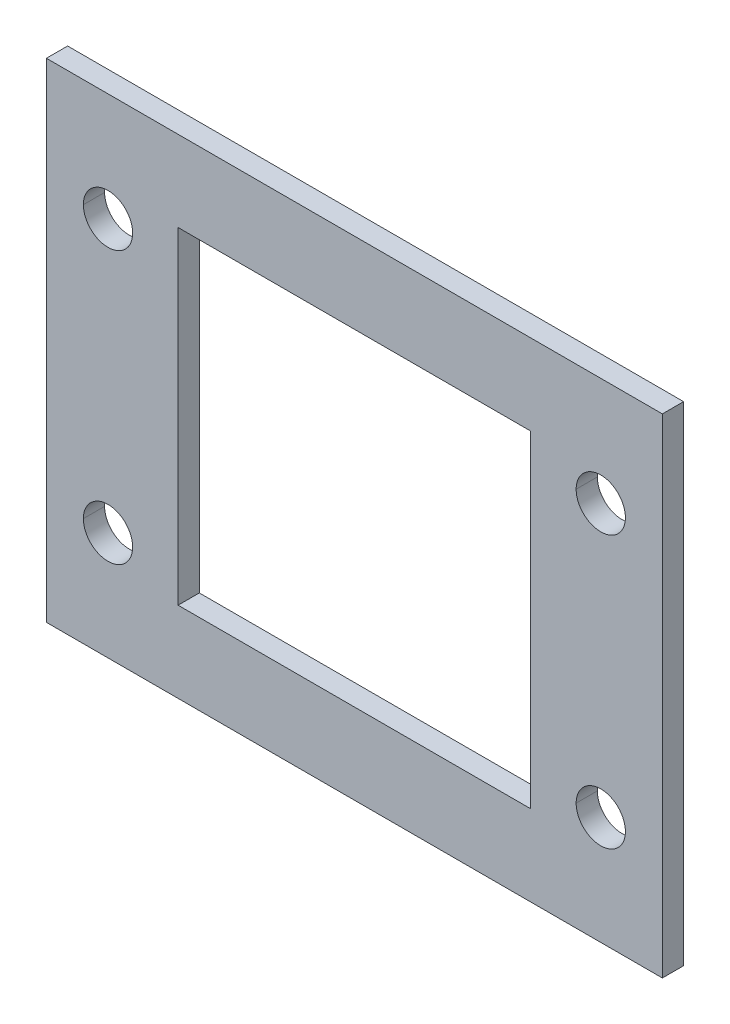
ISO-10303-21;
HEADER;
FILE_DESCRIPTION(('STEP AP214'),'2;1');
FILE_NAME('part.step','',(''),(''),'','','');
FILE_SCHEMA(('AUTOMOTIVE_DESIGN { 1 0 10303 214 1 1 1 1 }'));
ENDSEC;
DATA;
#1=APPLICATION_CONTEXT('core data for automotive mechanical design processes');
#2=APPLICATION_PROTOCOL_DEFINITION('international standard','automotive_design',2000,#1);
#3=PRODUCT_CONTEXT('',#1,'mechanical');
#4=PRODUCT('Part','Part','',(#3));
#5=PRODUCT_RELATED_PRODUCT_CATEGORY('part','',(#4));
#6=PRODUCT_DEFINITION_FORMATION('','',#4);
#7=PRODUCT_DEFINITION_CONTEXT('part definition',#1,'design');
#8=PRODUCT_DEFINITION('design','',#6,#7);
#9=PRODUCT_DEFINITION_SHAPE('','',#8);
#10=(LENGTH_UNIT() NAMED_UNIT(*) SI_UNIT(.MILLI.,.METRE.));
#11=(NAMED_UNIT(*) PLANE_ANGLE_UNIT() SI_UNIT($,.RADIAN.));
#12=(NAMED_UNIT(*) SI_UNIT($,.STERADIAN.) SOLID_ANGLE_UNIT());
#13=UNCERTAINTY_MEASURE_WITH_UNIT(LENGTH_MEASURE(1.E-05),#10,'distance_accuracy_value','');
#14=(GEOMETRIC_REPRESENTATION_CONTEXT(3) GLOBAL_UNCERTAINTY_ASSIGNED_CONTEXT((#13)) GLOBAL_UNIT_ASSIGNED_CONTEXT((#10,
#11,#12)) REPRESENTATION_CONTEXT('',''));
#15=CARTESIAN_POINT('',(0.,0.,0.));
#16=DIRECTION('',(0.,0.,1.));
#17=DIRECTION('',(1.,0.,0.));
#18=AXIS2_PLACEMENT_3D('',#15,#16,#17);
#19=CARTESIAN_POINT('',(3.82808590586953,41.3391777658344,23.2084991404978));
#20=DIRECTION('',(0.,0.,-1.));
#21=DIRECTION('',(-1.,0.,0.));
#22=AXIS2_PLACEMENT_3D('',#19,#20,#21);
#23=CYLINDRICAL_SURFACE('',#22,2.9);
#24=DIRECTION('',(0.,0.,-1.));
#25=VECTOR('',#24,1.);
#26=CARTESIAN_POINT('',(6.72808590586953,41.3391777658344,23.2084991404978));
#27=LINE('',#26,#25);
#28=CARTESIAN_POINT('',(6.72808590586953,41.3391777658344,15.0060604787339));
#29=VERTEX_POINT('',#28);
#30=CARTESIAN_POINT('',(6.72808590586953,41.3391777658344,12.5060604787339));
#31=VERTEX_POINT('',#30);
#32=EDGE_CURVE('E496',#29,#31,#27,.T.);
#33=ORIENTED_EDGE('',*,*,#32,.F.);
#34=CARTESIAN_POINT('',(3.82808590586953,41.3391777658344,15.0060604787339));
#35=DIRECTION('',(0.,0.,-1.));
#36=DIRECTION('',(-1.,0.,0.));
#37=AXIS2_PLACEMENT_3D('',#34,#35,#36);
#38=CIRCLE('',#37,2.9);
#39=CARTESIAN_POINT('',(0.92808590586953,41.3391777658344,15.0060604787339));
#40=VERTEX_POINT('',#39);
#41=EDGE_CURVE('E238',#40,#29,#38,.T.);
#42=ORIENTED_EDGE('',*,*,#41,.F.);
#43=DIRECTION('',(0.,0.,-1.));
#44=VECTOR('',#43,1.);
#45=CARTESIAN_POINT('',(0.92808590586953,41.3391777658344,23.2084991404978));
#46=LINE('',#45,#44);
#47=CARTESIAN_POINT('',(0.92808590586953,41.3391777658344,12.5060604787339));
#48=VERTEX_POINT('',#47);
#49=EDGE_CURVE('E490',#40,#48,#46,.T.);
#50=ORIENTED_EDGE('',*,*,#49,.T.);
#51=CARTESIAN_POINT('',(3.82808590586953,41.3391777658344,12.5060604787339));
#52=DIRECTION('',(0.,0.,1.));
#53=DIRECTION('',(1.,0.,0.));
#54=AXIS2_PLACEMENT_3D('',#51,#52,#53);
#55=CIRCLE('',#54,2.9);
#56=EDGE_CURVE('E242',#31,#48,#55,.T.);
#57=ORIENTED_EDGE('',*,*,#56,.F.);
#58=EDGE_LOOP('',(#33,#42,#50,#57));
#59=FACE_BOUND('',#58,.T.);
#60=ADVANCED_FACE('F15',(#59),#23,.F.);
#61=CARTESIAN_POINT('',(-54.1719140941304,41.3391777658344,23.2084991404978));
#62=DIRECTION('',(0.,0.,-1.));
#63=DIRECTION('',(-1.,0.,0.));
#64=AXIS2_PLACEMENT_3D('',#61,#62,#63);
#65=CYLINDRICAL_SURFACE('',#64,2.9);
#66=DIRECTION('',(0.,0.,-1.));
#67=VECTOR('',#66,1.);
#68=CARTESIAN_POINT('',(-51.2719140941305,41.3391777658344,23.2084991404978));
#69=LINE('',#68,#67);
#70=CARTESIAN_POINT('',(-51.2719140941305,41.3391777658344,15.0060604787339));
#71=VERTEX_POINT('',#70);
#72=CARTESIAN_POINT('',(-51.2719140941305,41.3391777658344,12.5060604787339));
#73=VERTEX_POINT('',#72);
#74=EDGE_CURVE('E512',#71,#73,#69,.T.);
#75=ORIENTED_EDGE('',*,*,#74,.F.);
#76=CARTESIAN_POINT('',(-54.1719140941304,41.3391777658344,15.0060604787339));
#77=DIRECTION('',(0.,0.,-1.));
#78=DIRECTION('',(-1.,0.,0.));
#79=AXIS2_PLACEMENT_3D('',#76,#77,#78);
#80=CIRCLE('',#79,2.9);
#81=CARTESIAN_POINT('',(-57.0719140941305,41.3391777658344,15.0060604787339));
#82=VERTEX_POINT('',#81);
#83=EDGE_CURVE('E235',#82,#71,#80,.T.);
#84=ORIENTED_EDGE('',*,*,#83,.F.);
#85=DIRECTION('',(0.,0.,-1.));
#86=VECTOR('',#85,1.);
#87=CARTESIAN_POINT('',(-57.0719140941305,41.3391777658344,23.2084991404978));
#88=LINE('',#87,#86);
#89=CARTESIAN_POINT('',(-57.0719140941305,41.3391777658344,12.5060604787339));
#90=VERTEX_POINT('',#89);
#91=EDGE_CURVE('E175',#82,#90,#88,.T.);
#92=ORIENTED_EDGE('',*,*,#91,.T.);
#93=CARTESIAN_POINT('',(-54.1719140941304,41.3391777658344,12.5060604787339));
#94=DIRECTION('',(0.,0.,1.));
#95=DIRECTION('',(1.,0.,0.));
#96=AXIS2_PLACEMENT_3D('',#93,#94,#95);
#97=CIRCLE('',#96,2.9);
#98=EDGE_CURVE('E169',#73,#90,#97,.T.);
#99=ORIENTED_EDGE('',*,*,#98,.F.);
#100=EDGE_LOOP('',(#75,#84,#92,#99));
#101=FACE_BOUND('',#100,.T.);
#102=ADVANCED_FACE('F433',(#101),#65,.F.);
#103=CARTESIAN_POINT('',(3.82808590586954,9.33917776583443,71.6143637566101));
#104=DIRECTION('',(0.,0.,-1.));
#105=DIRECTION('',(-1.,0.,0.));
#106=AXIS2_PLACEMENT_3D('',#103,#104,#105);
#107=CYLINDRICAL_SURFACE('',#106,2.9);
#108=DIRECTION('',(0.,0.,-1.));
#109=VECTOR('',#108,1.);
#110=CARTESIAN_POINT('',(6.72808590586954,9.33917776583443,71.6143637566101));
#111=LINE('',#110,#109);
#112=CARTESIAN_POINT('',(6.72808590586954,9.33917776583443,15.0060604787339));
#113=VERTEX_POINT('',#112);
#114=CARTESIAN_POINT('',(6.72808590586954,9.33917776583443,12.5060604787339));
#115=VERTEX_POINT('',#114);
#116=EDGE_CURVE('E183',#113,#115,#111,.T.);
#117=ORIENTED_EDGE('',*,*,#116,.F.);
#118=CARTESIAN_POINT('',(3.82808590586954,9.33917776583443,15.0060604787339));
#119=DIRECTION('',(0.,0.,-1.));
#120=DIRECTION('',(-1.,0.,0.));
#121=AXIS2_PLACEMENT_3D('',#118,#119,#120);
#122=CIRCLE('',#121,2.9);
#123=CARTESIAN_POINT('',(0.928085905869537,9.33917776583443,15.0060604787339));
#124=VERTEX_POINT('',#123);
#125=EDGE_CURVE('E230',#124,#113,#122,.T.);
#126=ORIENTED_EDGE('',*,*,#125,.F.);
#127=DIRECTION('',(0.,0.,-1.));
#128=VECTOR('',#127,1.);
#129=CARTESIAN_POINT('',(0.928085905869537,9.33917776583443,71.6143637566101));
#130=LINE('',#129,#128);
#131=CARTESIAN_POINT('',(0.928085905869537,9.33917776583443,12.5060604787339));
#132=VERTEX_POINT('',#131);
#133=EDGE_CURVE('E184',#124,#132,#130,.T.);
#134=ORIENTED_EDGE('',*,*,#133,.T.);
#135=CARTESIAN_POINT('',(3.82808590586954,9.33917776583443,12.5060604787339));
#136=DIRECTION('',(0.,0.,1.));
#137=DIRECTION('',(-1.,0.,0.));
#138=AXIS2_PLACEMENT_3D('',#135,#136,#137);
#139=CIRCLE('',#138,2.9);
#140=EDGE_CURVE('E239',#115,#132,#139,.T.);
#141=ORIENTED_EDGE('',*,*,#140,.F.);
#142=EDGE_LOOP('',(#117,#126,#134,#141));
#143=FACE_BOUND('',#142,.T.);
#144=ADVANCED_FACE('F361',(#143),#107,.F.);
#145=CARTESIAN_POINT('',(-54.1719140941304,9.33917776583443,71.6143637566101));
#146=DIRECTION('',(0.,0.,-1.));
#147=DIRECTION('',(-1.,0.,0.));
#148=AXIS2_PLACEMENT_3D('',#145,#146,#147);
#149=CYLINDRICAL_SURFACE('',#148,2.9);
#150=DIRECTION('',(0.,0.,-1.));
#151=VECTOR('',#150,1.);
#152=CARTESIAN_POINT('',(-51.2719140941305,9.33917776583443,71.6143637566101));
#153=LINE('',#152,#151);
#154=CARTESIAN_POINT('',(-51.2719140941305,9.33917776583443,15.0060604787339));
#155=VERTEX_POINT('',#154);
#156=CARTESIAN_POINT('',(-51.2719140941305,9.33917776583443,12.5060604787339));
#157=VERTEX_POINT('',#156);
#158=EDGE_CURVE('E193',#155,#157,#153,.T.);
#159=ORIENTED_EDGE('',*,*,#158,.F.);
#160=CARTESIAN_POINT('',(-54.1719140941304,9.33917776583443,15.0060604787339));
#161=DIRECTION('',(0.,0.,-1.));
#162=DIRECTION('',(-1.,0.,0.));
#163=AXIS2_PLACEMENT_3D('',#160,#161,#162);
#164=CIRCLE('',#163,2.9);
#165=CARTESIAN_POINT('',(-57.0719140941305,9.33917776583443,15.0060604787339));
#166=VERTEX_POINT('',#165);
#167=EDGE_CURVE('E227',#166,#155,#164,.T.);
#168=ORIENTED_EDGE('',*,*,#167,.F.);
#169=DIRECTION('',(0.,0.,-1.));
#170=VECTOR('',#169,1.);
#171=CARTESIAN_POINT('',(-57.0719140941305,9.33917776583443,71.6143637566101));
#172=LINE('',#171,#170);
#173=CARTESIAN_POINT('',(-57.0719140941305,9.33917776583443,12.5060604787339));
#174=VERTEX_POINT('',#173);
#175=EDGE_CURVE('E194',#166,#174,#172,.T.);
#176=ORIENTED_EDGE('',*,*,#175,.T.);
#177=CARTESIAN_POINT('',(-54.1719140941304,9.33917776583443,12.5060604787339));
#178=DIRECTION('',(0.,0.,1.));
#179=DIRECTION('',(1.,0.,0.));
#180=AXIS2_PLACEMENT_3D('',#177,#178,#179);
#181=CIRCLE('',#180,2.9);
#182=EDGE_CURVE('E163',#157,#174,#181,.T.);
#183=ORIENTED_EDGE('',*,*,#182,.F.);
#184=EDGE_LOOP('',(#159,#168,#176,#183));
#185=FACE_BOUND('',#184,.T.);
#186=ADVANCED_FACE('F355',(#185),#149,.F.);
#187=CARTESIAN_POINT('',(-45.9219140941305,6.08917776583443,71.6143637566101));
#188=DIRECTION('',(1.,0.,0.));
#189=DIRECTION('',(0.,1.,0.));
#190=AXIS2_PLACEMENT_3D('',#187,#188,#189);
#191=PLANE('',#190);
#192=DIRECTION('',(0.,0.,-1.));
#193=VECTOR('',#192,1.);
#194=CARTESIAN_POINT('',(-45.9219140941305,6.08917776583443,71.6143637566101));
#195=LINE('',#194,#193);
#196=CARTESIAN_POINT('',(-45.9219140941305,6.08917776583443,15.0060604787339));
#197=VERTEX_POINT('',#196);
#198=CARTESIAN_POINT('',(-45.9219140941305,6.08917776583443,12.5060604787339));
#199=VERTEX_POINT('',#198);
#200=EDGE_CURVE('E10',#197,#199,#195,.T.);
#201=ORIENTED_EDGE('',*,*,#200,.T.);
#202=DIRECTION('',(0.,-1.,0.));
#203=VECTOR('',#202,1.);
#204=CARTESIAN_POINT('',(-45.9219140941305,6.08917776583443,12.5060604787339));
#205=LINE('',#204,#203);
#206=CARTESIAN_POINT('',(-45.9219140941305,44.5891777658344,12.5060604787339));
#207=VERTEX_POINT('',#206);
#208=EDGE_CURVE('E156',#207,#199,#205,.T.);
#209=ORIENTED_EDGE('',*,*,#208,.F.);
#210=DIRECTION('',(0.,0.,-1.));
#211=VECTOR('',#210,1.);
#212=CARTESIAN_POINT('',(-45.9219140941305,44.5891777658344,71.6143637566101));
#213=LINE('',#212,#211);
#214=CARTESIAN_POINT('',(-45.9219140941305,44.5891777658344,15.0060604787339));
#215=VERTEX_POINT('',#214);
#216=EDGE_CURVE('E149',#215,#207,#213,.T.);
#217=ORIENTED_EDGE('',*,*,#216,.F.);
#218=DIRECTION('',(0.,1.,0.));
#219=VECTOR('',#218,1.);
#220=CARTESIAN_POINT('',(-45.9219140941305,6.08917776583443,15.0060604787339));
#221=LINE('',#220,#219);
#222=EDGE_CURVE('E223',#197,#215,#221,.T.);
#223=ORIENTED_EDGE('',*,*,#222,.F.);
#224=EDGE_LOOP('',(#201,#209,#217,#223));
#225=FACE_BOUND('',#224,.T.);
#226=ADVANCED_FACE('F360',(#225),#191,.T.);
#227=CARTESIAN_POINT('',(-45.9219140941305,6.08917776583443,71.6143637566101));
#228=DIRECTION('',(0.,1.,0.));
#229=DIRECTION('',(1.,0.,0.));
#230=AXIS2_PLACEMENT_3D('',#227,#228,#229);
#231=PLANE('',#230);
#232=DIRECTION('',(0.,0.,-1.));
#233=VECTOR('',#232,1.);
#234=CARTESIAN_POINT('',(-4.42191409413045,6.08917776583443,71.6143637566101));
#235=LINE('',#234,#233);
#236=CARTESIAN_POINT('',(-4.42191409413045,6.08917776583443,15.0060604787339));
#237=VERTEX_POINT('',#236);
#238=CARTESIAN_POINT('',(-4.42191409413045,6.08917776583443,12.5060604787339));
#239=VERTEX_POINT('',#238);
#240=EDGE_CURVE('E18',#237,#239,#235,.T.);
#241=ORIENTED_EDGE('',*,*,#240,.T.);
#242=DIRECTION('',(1.,0.,0.));
#243=VECTOR('',#242,1.);
#244=CARTESIAN_POINT('',(-45.9219140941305,6.08917776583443,12.5060604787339));
#245=LINE('',#244,#243);
#246=EDGE_CURVE('E161',#199,#239,#245,.T.);
#247=ORIENTED_EDGE('',*,*,#246,.F.);
#248=ORIENTED_EDGE('',*,*,#200,.F.);
#249=DIRECTION('',(-1.,0.,0.));
#250=VECTOR('',#249,1.);
#251=CARTESIAN_POINT('',(-45.9219140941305,6.08917776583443,15.0060604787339));
#252=LINE('',#251,#250);
#253=EDGE_CURVE('E219',#237,#197,#252,.T.);
#254=ORIENTED_EDGE('',*,*,#253,.F.);
#255=EDGE_LOOP('',(#241,#247,#248,#254));
#256=FACE_BOUND('',#255,.T.);
#257=ADVANCED_FACE('F409',(#256),#231,.T.);
#258=CARTESIAN_POINT('',(-4.42191409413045,6.08917776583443,71.6143637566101));
#259=DIRECTION('',(-1.,0.,0.));
#260=DIRECTION('',(0.,0.,1.));
#261=AXIS2_PLACEMENT_3D('',#258,#259,#260);
#262=PLANE('',#261);
#263=DIRECTION('',(0.,0.,-1.));
#264=VECTOR('',#263,1.);
#265=CARTESIAN_POINT('',(-4.42191409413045,44.5891777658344,71.6143637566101));
#266=LINE('',#265,#264);
#267=CARTESIAN_POINT('',(-4.42191409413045,44.5891777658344,15.0060604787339));
#268=VERTEX_POINT('',#267);
#269=CARTESIAN_POINT('',(-4.42191409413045,44.5891777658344,12.5060604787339));
#270=VERTEX_POINT('',#269);
#271=EDGE_CURVE('E138',#268,#270,#266,.T.);
#272=ORIENTED_EDGE('',*,*,#271,.T.);
#273=DIRECTION('',(0.,1.,0.));
#274=VECTOR('',#273,1.);
#275=CARTESIAN_POINT('',(-4.42191409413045,6.08917776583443,12.5060604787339));
#276=LINE('',#275,#274);
#277=EDGE_CURVE('E142',#239,#270,#276,.T.);
#278=ORIENTED_EDGE('',*,*,#277,.F.);
#279=ORIENTED_EDGE('',*,*,#240,.F.);
#280=DIRECTION('',(0.,-1.,0.));
#281=VECTOR('',#280,1.);
#282=CARTESIAN_POINT('',(-4.42191409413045,6.08917776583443,15.0060604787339));
#283=LINE('',#282,#281);
#284=EDGE_CURVE('E144',#268,#237,#283,.T.);
#285=ORIENTED_EDGE('',*,*,#284,.F.);
#286=EDGE_LOOP('',(#272,#278,#279,#285));
#287=FACE_BOUND('',#286,.T.);
#288=ADVANCED_FACE('F140',(#287),#262,.T.);
#289=CARTESIAN_POINT('',(-45.9219140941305,44.5891777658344,71.6143637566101));
#290=DIRECTION('',(0.,-1.,0.));
#291=DIRECTION('',(0.,0.,-1.));
#292=AXIS2_PLACEMENT_3D('',#289,#290,#291);
#293=PLANE('',#292);
#294=ORIENTED_EDGE('',*,*,#216,.T.);
#295=DIRECTION('',(-1.,0.,0.));
#296=VECTOR('',#295,1.);
#297=CARTESIAN_POINT('',(-45.9219140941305,44.5891777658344,12.5060604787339));
#298=LINE('',#297,#296);
#299=EDGE_CURVE('E151',#270,#207,#298,.T.);
#300=ORIENTED_EDGE('',*,*,#299,.F.);
#301=ORIENTED_EDGE('',*,*,#271,.F.);
#302=DIRECTION('',(1.,0.,0.));
#303=VECTOR('',#302,1.);
#304=CARTESIAN_POINT('',(-45.9219140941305,44.5891777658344,15.0060604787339));
#305=LINE('',#304,#303);
#306=EDGE_CURVE('E214',#215,#268,#305,.T.);
#307=ORIENTED_EDGE('',*,*,#306,.F.);
#308=EDGE_LOOP('',(#294,#300,#301,#307));
#309=FACE_BOUND('',#308,.T.);
#310=ADVANCED_FACE('F152',(#309),#293,.T.);
#311=CARTESIAN_POINT('',(-61.4219140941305,54.0891777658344,15.0060604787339));
#312=DIRECTION('',(0.,-1.,0.));
#313=DIRECTION('',(0.,0.,-1.));
#314=AXIS2_PLACEMENT_3D('',#311,#312,#313);
#315=PLANE('',#314);
#316=DIRECTION('',(-1.,0.,0.));
#317=VECTOR('',#316,1.);
#318=CARTESIAN_POINT('',(-61.4219140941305,54.0891777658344,12.5060604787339));
#319=LINE('',#318,#317);
#320=CARTESIAN_POINT('',(11.0780859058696,54.0891777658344,12.5060604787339));
#321=VERTEX_POINT('',#320);
#322=CARTESIAN_POINT('',(-61.4219140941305,54.0891777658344,12.5060604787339));
#323=VERTEX_POINT('',#322);
#324=EDGE_CURVE('E249',#321,#323,#319,.T.);
#325=ORIENTED_EDGE('',*,*,#324,.T.);
#326=DIRECTION('',(0.,0.,-1.));
#327=VECTOR('',#326,1.);
#328=CARTESIAN_POINT('',(-61.4219140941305,54.0891777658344,15.0060604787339));
#329=LINE('',#328,#327);
#330=CARTESIAN_POINT('',(-61.4219140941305,54.0891777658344,15.0060604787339));
#331=VERTEX_POINT('',#330);
#332=EDGE_CURVE('E264',#331,#323,#329,.T.);
#333=ORIENTED_EDGE('',*,*,#332,.F.);
#334=DIRECTION('',(-1.,0.,0.));
#335=VECTOR('',#334,1.);
#336=CARTESIAN_POINT('',(-61.4219140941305,54.0891777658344,15.0060604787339));
#337=LINE('',#336,#335);
#338=CARTESIAN_POINT('',(11.0780859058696,54.0891777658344,15.0060604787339));
#339=VERTEX_POINT('',#338);
#340=EDGE_CURVE('E210',#339,#331,#337,.T.);
#341=ORIENTED_EDGE('',*,*,#340,.F.);
#342=DIRECTION('',(0.,0.,-1.));
#343=VECTOR('',#342,1.);
#344=CARTESIAN_POINT('',(11.0780859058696,54.0891777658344,15.0060604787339));
#345=LINE('',#344,#343);
#346=EDGE_CURVE('E270',#339,#321,#345,.T.);
#347=ORIENTED_EDGE('',*,*,#346,.T.);
#348=EDGE_LOOP('',(#325,#333,#341,#347));
#349=FACE_BOUND('',#348,.T.);
#350=ADVANCED_FACE('F382',(#349),#315,.F.);
#351=CARTESIAN_POINT('',(11.0780859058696,-3.41082223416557,15.0060604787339));
#352=DIRECTION('',(-1.,0.,0.));
#353=DIRECTION('',(0.,0.,1.));
#354=AXIS2_PLACEMENT_3D('',#351,#352,#353);
#355=PLANE('',#354);
#356=DIRECTION('',(0.,1.,0.));
#357=VECTOR('',#356,1.);
#358=CARTESIAN_POINT('',(11.0780859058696,-3.41082223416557,12.5060604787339));
#359=LINE('',#358,#357);
#360=CARTESIAN_POINT('',(11.0780859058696,-3.41082223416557,12.5060604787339));
#361=VERTEX_POINT('',#360);
#362=EDGE_CURVE('E251',#361,#321,#359,.T.);
#363=ORIENTED_EDGE('',*,*,#362,.T.);
#364=ORIENTED_EDGE('',*,*,#346,.F.);
#365=DIRECTION('',(0.,1.,0.));
#366=VECTOR('',#365,1.);
#367=CARTESIAN_POINT('',(11.0780859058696,-3.41082223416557,15.0060604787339));
#368=LINE('',#367,#366);
#369=CARTESIAN_POINT('',(11.0780859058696,-3.41082223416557,15.0060604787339));
#370=VERTEX_POINT('',#369);
#371=EDGE_CURVE('E206',#370,#339,#368,.T.);
#372=ORIENTED_EDGE('',*,*,#371,.F.);
#373=DIRECTION('',(0.,0.,-1.));
#374=VECTOR('',#373,1.);
#375=CARTESIAN_POINT('',(11.0780859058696,-3.41082223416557,15.0060604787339));
#376=LINE('',#375,#374);
#377=EDGE_CURVE('E267',#370,#361,#376,.T.);
#378=ORIENTED_EDGE('',*,*,#377,.T.);
#379=EDGE_LOOP('',(#363,#364,#372,#378));
#380=FACE_BOUND('',#379,.T.);
#381=ADVANCED_FACE('F372',(#380),#355,.F.);
#382=CARTESIAN_POINT('',(-61.4219140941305,-3.41082223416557,15.0060604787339));
#383=DIRECTION('',(0.,1.,0.));
#384=DIRECTION('',(1.,0.,0.));
#385=AXIS2_PLACEMENT_3D('',#382,#383,#384);
#386=PLANE('',#385);
#387=DIRECTION('',(1.,0.,0.));
#388=VECTOR('',#387,1.);
#389=CARTESIAN_POINT('',(-61.4219140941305,-3.41082223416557,12.5060604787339));
#390=LINE('',#389,#388);
#391=CARTESIAN_POINT('',(-61.4219140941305,-3.41082223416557,12.5060604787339));
#392=VERTEX_POINT('',#391);
#393=EDGE_CURVE('E255',#392,#361,#390,.T.);
#394=ORIENTED_EDGE('',*,*,#393,.T.);
#395=ORIENTED_EDGE('',*,*,#377,.F.);
#396=DIRECTION('',(1.,0.,0.));
#397=VECTOR('',#396,1.);
#398=CARTESIAN_POINT('',(-61.4219140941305,-3.41082223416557,15.0060604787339));
#399=LINE('',#398,#397);
#400=CARTESIAN_POINT('',(-61.4219140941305,-3.41082223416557,15.0060604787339));
#401=VERTEX_POINT('',#400);
#402=EDGE_CURVE('E202',#401,#370,#399,.T.);
#403=ORIENTED_EDGE('',*,*,#402,.F.);
#404=DIRECTION('',(0.,0.,-1.));
#405=VECTOR('',#404,1.);
#406=CARTESIAN_POINT('',(-61.4219140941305,-3.41082223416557,15.0060604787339));
#407=LINE('',#406,#405);
#408=EDGE_CURVE('E261',#401,#392,#407,.T.);
#409=ORIENTED_EDGE('',*,*,#408,.T.);
#410=EDGE_LOOP('',(#394,#395,#403,#409));
#411=FACE_BOUND('',#410,.T.);
#412=ADVANCED_FACE('F340',(#411),#386,.F.);
#413=CARTESIAN_POINT('',(-61.4219140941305,-3.41082223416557,15.0060604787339));
#414=DIRECTION('',(1.,0.,0.));
#415=DIRECTION('',(0.,1.,0.));
#416=AXIS2_PLACEMENT_3D('',#413,#414,#415);
#417=PLANE('',#416);
#418=DIRECTION('',(0.,-1.,0.));
#419=VECTOR('',#418,1.);
#420=CARTESIAN_POINT('',(-61.4219140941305,-3.41082223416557,12.5060604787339));
#421=LINE('',#420,#419);
#422=EDGE_CURVE('E246',#323,#392,#421,.T.);
#423=ORIENTED_EDGE('',*,*,#422,.T.);
#424=ORIENTED_EDGE('',*,*,#408,.F.);
#425=DIRECTION('',(0.,-1.,0.));
#426=VECTOR('',#425,1.);
#427=CARTESIAN_POINT('',(-61.4219140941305,-3.41082223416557,15.0060604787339));
#428=LINE('',#427,#426);
#429=EDGE_CURVE('E198',#331,#401,#428,.T.);
#430=ORIENTED_EDGE('',*,*,#429,.F.);
#431=ORIENTED_EDGE('',*,*,#332,.T.);
#432=EDGE_LOOP('',(#423,#424,#430,#431));
#433=FACE_BOUND('',#432,.T.);
#434=ADVANCED_FACE('F335',(#433),#417,.F.);
#435=CARTESIAN_POINT('',(-61.4219140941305,54.0891777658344,12.5060604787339));
#436=DIRECTION('',(0.,0.,-1.));
#437=DIRECTION('',(0.,-1.,0.));
#438=AXIS2_PLACEMENT_3D('',#435,#436,#437);
#439=PLANE('',#438);
#440=CARTESIAN_POINT('',(3.82808590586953,41.3391777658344,12.5060604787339));
#441=DIRECTION('',(0.,0.,1.));
#442=DIRECTION('',(1.,0.,0.));
#443=AXIS2_PLACEMENT_3D('',#440,#441,#442);
#444=CIRCLE('',#443,2.9);
#445=EDGE_CURVE('E484',#48,#31,#444,.T.);
#446=ORIENTED_EDGE('',*,*,#445,.T.);
#447=ORIENTED_EDGE('',*,*,#56,.T.);
#448=EDGE_LOOP('',(#446,#447));
#449=FACE_BOUND('',#448,.T.);
#450=CARTESIAN_POINT('',(3.82808590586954,9.33917776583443,12.5060604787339));
#451=DIRECTION('',(0.,0.,1.));
#452=DIRECTION('',(-1.,0.,0.));
#453=AXIS2_PLACEMENT_3D('',#450,#451,#452);
#454=CIRCLE('',#453,2.9);
#455=EDGE_CURVE('E189',#132,#115,#454,.T.);
#456=ORIENTED_EDGE('',*,*,#455,.T.);
#457=ORIENTED_EDGE('',*,*,#140,.T.);
#458=EDGE_LOOP('',(#456,#457));
#459=FACE_BOUND('',#458,.T.);
#460=ORIENTED_EDGE('',*,*,#277,.T.);
#461=ORIENTED_EDGE('',*,*,#299,.T.);
#462=ORIENTED_EDGE('',*,*,#208,.T.);
#463=ORIENTED_EDGE('',*,*,#246,.T.);
#464=EDGE_LOOP('',(#460,#461,#462,#463));
#465=FACE_BOUND('',#464,.T.);
#466=CARTESIAN_POINT('',(-54.1719140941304,9.33917776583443,12.5060604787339));
#467=DIRECTION('',(0.,0.,1.));
#468=DIRECTION('',(1.,0.,0.));
#469=AXIS2_PLACEMENT_3D('',#466,#467,#468);
#470=CIRCLE('',#469,2.9);
#471=EDGE_CURVE('E173',#174,#157,#470,.T.);
#472=ORIENTED_EDGE('',*,*,#471,.T.);
#473=ORIENTED_EDGE('',*,*,#182,.T.);
#474=EDGE_LOOP('',(#472,#473));
#475=FACE_BOUND('',#474,.T.);
#476=CARTESIAN_POINT('',(-54.1719140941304,41.3391777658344,12.5060604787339));
#477=DIRECTION('',(0.,0.,1.));
#478=DIRECTION('',(1.,0.,0.));
#479=AXIS2_PLACEMENT_3D('',#476,#477,#478);
#480=CIRCLE('',#479,2.9);
#481=EDGE_CURVE('E179',#90,#73,#480,.T.);
#482=ORIENTED_EDGE('',*,*,#481,.T.);
#483=ORIENTED_EDGE('',*,*,#98,.T.);
#484=EDGE_LOOP('',(#482,#483));
#485=FACE_BOUND('',#484,.T.);
#486=ORIENTED_EDGE('',*,*,#422,.F.);
#487=ORIENTED_EDGE('',*,*,#324,.F.);
#488=ORIENTED_EDGE('',*,*,#362,.F.);
#489=ORIENTED_EDGE('',*,*,#393,.F.);
#490=EDGE_LOOP('',(#486,#487,#488,#489));
#491=FACE_BOUND('',#490,.T.);
#492=ADVANCED_FACE('F159',(#449,#459,#465,#475,#485,#491),#439,.T.);
#493=CARTESIAN_POINT('',(-61.4219140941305,54.0891777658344,15.0060604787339));
#494=DIRECTION('',(0.,0.,-1.));
#495=DIRECTION('',(0.,-1.,0.));
#496=AXIS2_PLACEMENT_3D('',#493,#494,#495);
#497=PLANE('',#496);
#498=ORIENTED_EDGE('',*,*,#41,.T.);
#499=CARTESIAN_POINT('',(3.82808590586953,41.3391777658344,15.0060604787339));
#500=DIRECTION('',(0.,0.,-1.));
#501=DIRECTION('',(-1.,0.,0.));
#502=AXIS2_PLACEMENT_3D('',#499,#500,#501);
#503=CIRCLE('',#502,2.9);
#504=EDGE_CURVE('E503',#29,#40,#503,.T.);
#505=ORIENTED_EDGE('',*,*,#504,.T.);
#506=EDGE_LOOP('',(#498,#505));
#507=FACE_BOUND('',#506,.T.);
#508=ORIENTED_EDGE('',*,*,#83,.T.);
#509=CARTESIAN_POINT('',(-54.1719140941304,41.3391777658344,15.0060604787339));
#510=DIRECTION('',(0.,0.,-1.));
#511=DIRECTION('',(-1.,0.,0.));
#512=AXIS2_PLACEMENT_3D('',#509,#510,#511);
#513=CIRCLE('',#512,2.9);
#514=EDGE_CURVE('E494',#71,#82,#513,.T.);
#515=ORIENTED_EDGE('',*,*,#514,.T.);
#516=EDGE_LOOP('',(#508,#515));
#517=FACE_BOUND('',#516,.T.);
#518=ORIENTED_EDGE('',*,*,#125,.T.);
#519=CARTESIAN_POINT('',(3.82808590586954,9.33917776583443,15.0060604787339));
#520=DIRECTION('',(0.,0.,-1.));
#521=DIRECTION('',(-1.,0.,0.));
#522=AXIS2_PLACEMENT_3D('',#519,#520,#521);
#523=CIRCLE('',#522,2.9);
#524=EDGE_CURVE('E178',#113,#124,#523,.T.);
#525=ORIENTED_EDGE('',*,*,#524,.T.);
#526=EDGE_LOOP('',(#518,#525));
#527=FACE_BOUND('',#526,.T.);
#528=ORIENTED_EDGE('',*,*,#167,.T.);
#529=CARTESIAN_POINT('',(-54.1719140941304,9.33917776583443,15.0060604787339));
#530=DIRECTION('',(0.,0.,-1.));
#531=DIRECTION('',(-1.,0.,0.));
#532=AXIS2_PLACEMENT_3D('',#529,#530,#531);
#533=CIRCLE('',#532,2.9);
#534=EDGE_CURVE('E188',#155,#166,#533,.T.);
#535=ORIENTED_EDGE('',*,*,#534,.T.);
#536=EDGE_LOOP('',(#528,#535));
#537=FACE_BOUND('',#536,.T.);
#538=ORIENTED_EDGE('',*,*,#306,.T.);
#539=ORIENTED_EDGE('',*,*,#284,.T.);
#540=ORIENTED_EDGE('',*,*,#253,.T.);
#541=ORIENTED_EDGE('',*,*,#222,.T.);
#542=EDGE_LOOP('',(#538,#539,#540,#541));
#543=FACE_BOUND('',#542,.T.);
#544=ORIENTED_EDGE('',*,*,#429,.T.);
#545=ORIENTED_EDGE('',*,*,#402,.T.);
#546=ORIENTED_EDGE('',*,*,#371,.T.);
#547=ORIENTED_EDGE('',*,*,#340,.T.);
#548=EDGE_LOOP('',(#544,#545,#546,#547));
#549=FACE_BOUND('',#548,.T.);
#550=ADVANCED_FACE('F319',(#507,#517,#527,#537,#543,#549),#497,.F.);
#551=CARTESIAN_POINT('',(-54.1719140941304,9.33917776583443,71.6143637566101));
#552=DIRECTION('',(0.,0.,-1.));
#553=DIRECTION('',(-1.,0.,0.));
#554=AXIS2_PLACEMENT_3D('',#551,#552,#553);
#555=CYLINDRICAL_SURFACE('',#554,2.9);
#556=ORIENTED_EDGE('',*,*,#534,.F.);
#557=ORIENTED_EDGE('',*,*,#158,.T.);
#558=ORIENTED_EDGE('',*,*,#471,.F.);
#559=ORIENTED_EDGE('',*,*,#175,.F.);
#560=EDGE_LOOP('',(#556,#557,#558,#559));
#561=FACE_BOUND('',#560,.T.);
#562=ADVANCED_FACE('F309',(#561),#555,.F.);
#563=CARTESIAN_POINT('',(3.82808590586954,9.33917776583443,71.6143637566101));
#564=DIRECTION('',(0.,0.,-1.));
#565=DIRECTION('',(-1.,0.,0.));
#566=AXIS2_PLACEMENT_3D('',#563,#564,#565);
#567=CYLINDRICAL_SURFACE('',#566,2.9);
#568=ORIENTED_EDGE('',*,*,#524,.F.);
#569=ORIENTED_EDGE('',*,*,#116,.T.);
#570=ORIENTED_EDGE('',*,*,#455,.F.);
#571=ORIENTED_EDGE('',*,*,#133,.F.);
#572=EDGE_LOOP('',(#568,#569,#570,#571));
#573=FACE_BOUND('',#572,.T.);
#574=ADVANCED_FACE('F299',(#573),#567,.F.);
#575=CARTESIAN_POINT('',(-54.1719140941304,41.3391777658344,23.2084991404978));
#576=DIRECTION('',(0.,0.,-1.));
#577=DIRECTION('',(-1.,0.,0.));
#578=AXIS2_PLACEMENT_3D('',#575,#576,#577);
#579=CYLINDRICAL_SURFACE('',#578,2.9);
#580=ORIENTED_EDGE('',*,*,#514,.F.);
#581=ORIENTED_EDGE('',*,*,#74,.T.);
#582=ORIENTED_EDGE('',*,*,#481,.F.);
#583=ORIENTED_EDGE('',*,*,#91,.F.);
#584=EDGE_LOOP('',(#580,#581,#582,#583));
#585=FACE_BOUND('',#584,.T.);
#586=ADVANCED_FACE('F288',(#585),#579,.F.);
#587=CARTESIAN_POINT('',(3.82808590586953,41.3391777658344,23.2084991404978));
#588=DIRECTION('',(0.,0.,-1.));
#589=DIRECTION('',(-1.,0.,0.));
#590=AXIS2_PLACEMENT_3D('',#587,#588,#589);
#591=CYLINDRICAL_SURFACE('',#590,2.9);
#592=ORIENTED_EDGE('',*,*,#504,.F.);
#593=ORIENTED_EDGE('',*,*,#32,.T.);
#594=ORIENTED_EDGE('',*,*,#445,.F.);
#595=ORIENTED_EDGE('',*,*,#49,.F.);
#596=EDGE_LOOP('',(#592,#593,#594,#595));
#597=FACE_BOUND('',#596,.T.);
#598=ADVANCED_FACE('F283',(#597),#591,.F.);
#599=CLOSED_SHELL('',(#60,#102,#144,#186,#226,#257,#288,#310,#350,#381,#412,#434,#492,#550,#562,
#574,#586,#598));
#600=MANIFOLD_SOLID_BREP('B1',#599);
#601=ADVANCED_BREP_SHAPE_REPRESENTATION('',(#18,#600),#14);
#602=SHAPE_DEFINITION_REPRESENTATION(#9,#601);
ENDSEC;
END-ISO-10303-21;
